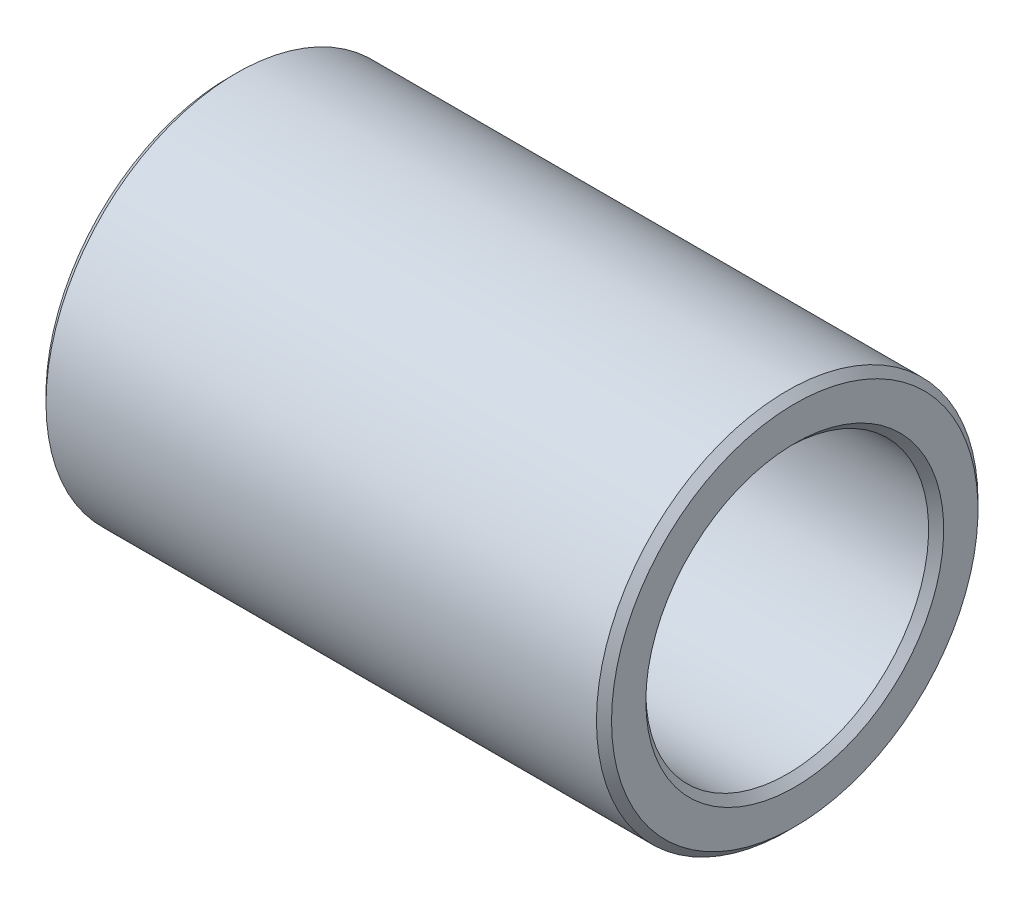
from build123d import *

# Parameters (mm, degrees)
SKETCH1_W     = 9.525
SKETCH1_H     = 0.83185
CHAMFER1_SIZE = 0.127


with BuildPart() as part:
    # Sketch1 → Revolve1 (revolve)
    with BuildSketch(Plane.XY, mode=Mode.PRIVATE) as revolve1_sk:
        with Locations((0, 2.797175)):
            Rectangle(SKETCH1_W, SKETCH1_H)
    revolve(revolve1_sk.sketch.rotate(Axis((0, 0, 0), (1, 0, 0)), 90), axis=Axis((0, 0, 0), (1, 0, 0)))

    # Chamfer1
    chamfer1_edges = [part.edges().sort_by_distance(p)[0] for p in [
        (-4.7625, 0, -3.2131),
        (4.7625, 0, -3.2131),
        (4.7625, 0, -2.38125),
        (-4.7625, 0, -2.38125),
    ]]
    chamfer(chamfer1_edges, length=CHAMFER1_SIZE)


solid = part.part
